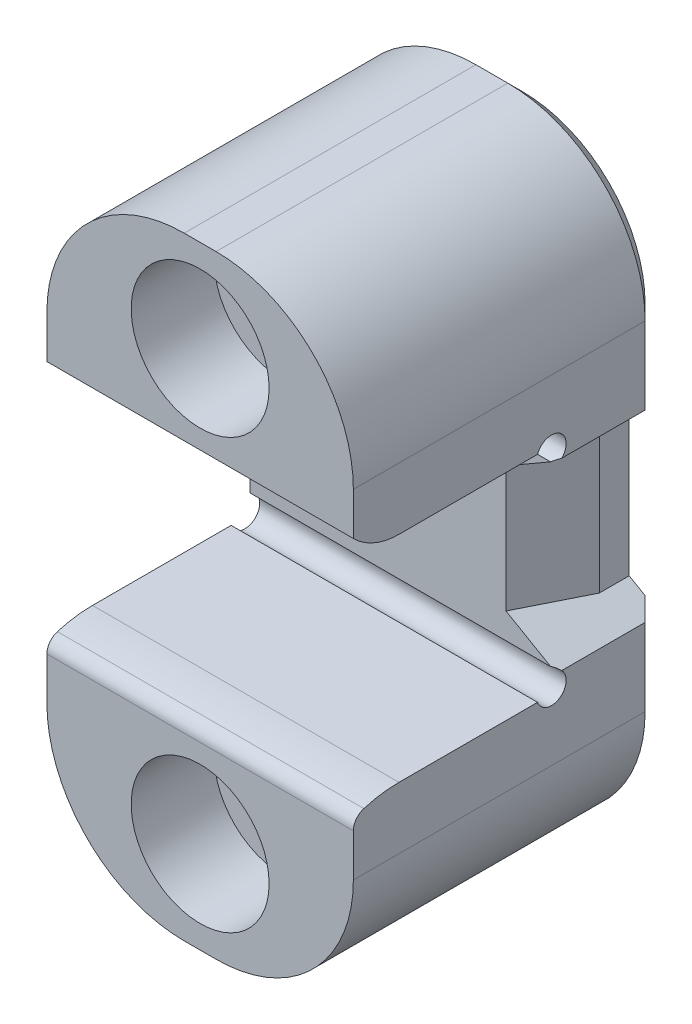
from build123d import *

# Parameters (mm, degrees)
EXTRUDE1_DEPTH        = 7.9375
FILLET1_R             = 7.112
CUT_EXTRUDE1_DEPTH    = 28.49630657
CUT_EXTRUDE2_DEPTH    = 28.49630657
SKETCH6_R             = 0.762
CUT_EXTRUDE3_DEPTH    = 28.49630657
F_6_CBORE_D           = 3.302
F_6_CBORE_CBORE_D     = 7.14502
F_6_CBORE_CBORE_DEPTH = 4.30022
CHAMFER3_SIZE         = 3.81
CHAMFER3_SIZE2        = 1.020886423
CHAMFER1_SIZE         = 0.762
F_8_32_TAPPED_HOLE1_D = 3.4544


with BuildPart() as part:
    # Sketch1 → Extrude1 (new, symmetric)
    with BuildSketch(Plane(origin=(0, 0, 0), x_dir=(0, 0, -1), z_dir=(1, 0, 0))):
        Polygon((0, 5.5626), (10.5156, 5.5626), (10.5156, -5.5626), (0, -5.5626), (0, -15.875), (15.875, -15.875), (15.875, 15.875), (0, 15.875), align=None)
    extrude(amount=EXTRUDE1_DEPTH, both=True)

    # Fillet1
    fillet1_edges = [part.edges().sort_by_distance(p)[0] for p in [
        (7.9375, -15.875, -7.9375),
        (7.9375, 15.875, -7.9375),
        (-7.9375, 15.875, -7.9375),
        (-7.9375, -15.875, -7.9375),
    ]]
    fillet(fillet1_edges, radius=FILLET1_R)

    # Sketch2 → Cut-Extrude1 (cut, through all)
    with BuildSketch(Plane(origin=(-7.9375, 0, -15.875), x_dir=(1, 0, 0), z_dir=(0, 0, 1))):
        Polygon((14.2875, 3.845956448), (17.4625, 5.679043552), (17.4625, -5.679043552), (14.2875, -3.845956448), align=None)
    extrude(amount=CUT_EXTRUDE1_DEPTH, mode=Mode.SUBTRACT)

    # Sketch5 → Cut-Extrude2 (cut, through all)
    with BuildSketch(Plane(origin=(7.9375, 0, 0), x_dir=(0, 0, -1), z_dir=(1, 0, 0))):
        with BuildLine():
            Line((-3.9878, -3.383619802), (2.3622, -3.383619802))
            Line((2.3622, -3.383619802), (2.3622, -5.5626))
            ThreePointArc((2.3622, -5.5626), (1.44332416, -5.62943462), (0.543790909, -5.828531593))
            ThreePointArc((0.543790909, -5.828531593), (0.150886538, -6.103444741), (0, -6.558619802))
            Line((0, -6.558619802), (-3.9878, -6.558619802))
            Line((-3.9878, -6.558619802), (-3.9878, -3.383619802))
        make_face()
        with BuildLine():
            Line((2.3622, 3.383619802), (2.3622, 5.5626))
            ThreePointArc((2.3622, 5.5626), (1.080400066, 5.82178595), (0, 6.558619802))
            Line((0, 6.558619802), (-3.9878, 6.558619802))
            Line((-3.9878, 6.558619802), (-3.9878, 3.383619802))
            Line((-3.9878, 3.383619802), (2.3622, 3.383619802))
        make_face()
    extrude(amount=-CUT_EXTRUDE2_DEPTH, mode=Mode.SUBTRACT)

    # Sketch6 → Cut-Extrude3 (cut, through all)
    with BuildSketch(Plane(origin=(7.9375, 0, 0), x_dir=(0, 0, -1), z_dir=(1, 0, 0))):
        with Locations((10.2616, 5.3086)):
            Circle(SKETCH6_R)
        with Locations((10.2616, -5.3086)):
            Circle(SKETCH6_R)
    extrude(amount=-CUT_EXTRUDE3_DEPTH, mode=Mode.SUBTRACT)

    # 6 CBORE (through all)
    with Locations(Plane.XY):
        with Locations((0, 11.1125), (0, -11.1125)):
            CounterBoreHole(F_6_CBORE_D / 2, F_6_CBORE_CBORE_D / 2, F_6_CBORE_CBORE_DEPTH)

    # Chamfer3
    chamfer3_edges = [part.edges().sort_by_distance(p)[0] for p in [
        (6.35, 0, -10.5156),
    ]]
    chamfer3_side = [part.faces().sort_by_distance(p)[0] for p in [
        (6.35, 0, -13.1953),
    ]]
    chamfer(chamfer3_edges, length=CHAMFER3_SIZE, length2=CHAMFER3_SIZE2, reference=chamfer3_side[0])

    # Chamfer1
    chamfer1_edges = [part.edges().sort_by_distance(p)[0] for p in [
        (7.9375, -6.76275, -15.875),
        (-7.9375, 0, -15.875),
        (0, 15.875, -15.875),
        (0, -15.875, -15.875),
        (-5.854443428, 13.791943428, -15.875),
        (-5.854443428, -13.791943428, -15.875),
        (5.854443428, 13.791943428, -15.875),
        (5.854443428, -13.791943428, -15.875),
        (7.9375, 6.76275, -15.875),
    ]]
    chamfer(chamfer1_edges, length=CHAMFER1_SIZE)

    # 8-32 Tapped Hole1 (through all)
    with Locations(Plane.XY.offset(-4.30022)):
        with Locations((0, 11.1125), (0, -11.1125)):
            Hole(F_8_32_TAPPED_HOLE1_D / 2)


solid = part.part
